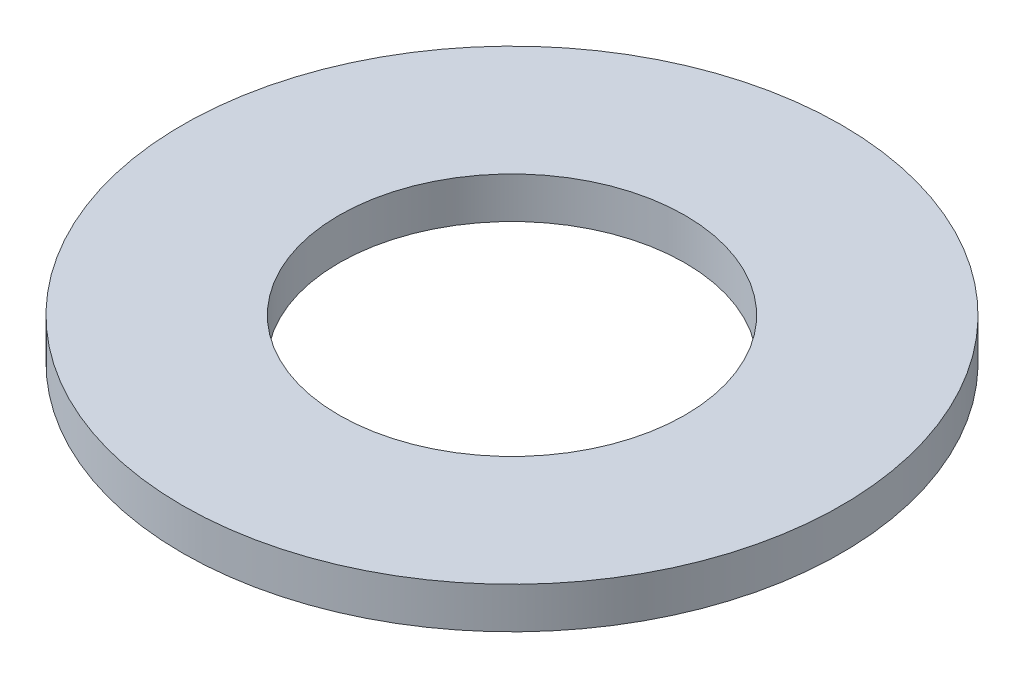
from build123d import *

# Parameters (mm, degrees)
ESQUISSE1_R      = 40
ESQUISSE1_R_2    = 21
EXTRUSION1_DEPTH = 5


with BuildPart() as part:
    # Esquisse1 → Extrusion1 (new body)
    with BuildSketch(Plane(origin=(0, 0, 0), x_dir=(1, 0, 0), z_dir=(0, 1, 0))):
        with Locations(Location((0, 0, 0), (0, 0, 270))):
            Circle(ESQUISSE1_R)
        with Locations(Location((0, 0, 0), (0, 0, 270))):
            Circle(ESQUISSE1_R_2, mode=Mode.SUBTRACT)
    extrude(amount=EXTRUSION1_DEPTH)


solid = part.part
